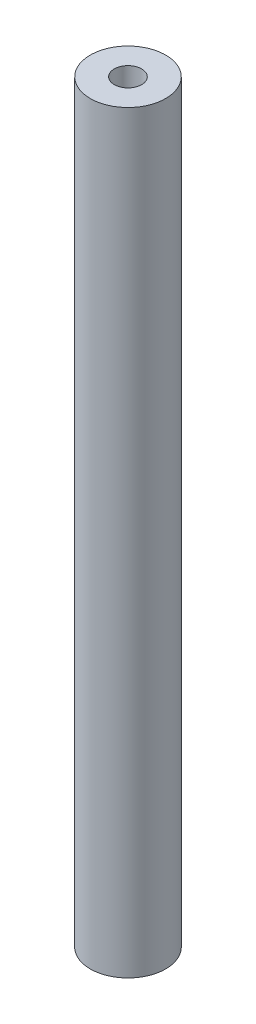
from build123d import *

# Parameters (mm, degrees)
SKETCH1_R                 = 4.7625
BOSS_EXTRUDE1_DEPTH       = 95.25
F_8_32_TAPPED_HOLE1_D     = 3.4544
F_8_32_TAPPED_HOLE1_DEPTH = 21.4376
F_8_32_TAPPED_HOLE1_TIP   = 1.037806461
F_8_32_TAPPED_HOLE2_D     = 3.4544
F_8_32_TAPPED_HOLE2_DEPTH = 21.4376
F_8_32_TAPPED_HOLE2_TIP   = 1.037806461


with BuildPart() as part:
    # Sketch1 → Boss-Extrude1 (new body)
    with BuildSketch(Plane(origin=(0, 0, 0), x_dir=(1, 0, 0), z_dir=(0, 1, 0))):
        with Locations(Location((0, 0, 0), (0, 0, 270))):
            Circle(SKETCH1_R)
    extrude(amount=BOSS_EXTRUDE1_DEPTH)

    # 8-32 Tapped Hole1
    with Locations(Plane(origin=(0, 0, 0), x_dir=(-1, 0, 0), z_dir=(0, -1, 0))):
        with Locations((0, 0)):
            Hole(F_8_32_TAPPED_HOLE1_D / 2, depth=F_8_32_TAPPED_HOLE1_DEPTH)
            with Locations((0, 0, -(F_8_32_TAPPED_HOLE1_DEPTH + F_8_32_TAPPED_HOLE1_TIP / 2))):  # 118° drill point
                Cone(0, F_8_32_TAPPED_HOLE1_D / 2, F_8_32_TAPPED_HOLE1_TIP, mode=Mode.SUBTRACT)

    # 8-32 Tapped Hole2
    with Locations(Plane(origin=(0, 95.25, 0), x_dir=(1, 0, 0), z_dir=(0, 1, 0))):
        with Locations((0, 0)):
            Hole(F_8_32_TAPPED_HOLE2_D / 2, depth=F_8_32_TAPPED_HOLE2_DEPTH)
            with Locations((0, 0, -(F_8_32_TAPPED_HOLE2_DEPTH + F_8_32_TAPPED_HOLE2_TIP / 2))):  # 118° drill point
                Cone(0, F_8_32_TAPPED_HOLE2_D / 2, F_8_32_TAPPED_HOLE2_TIP, mode=Mode.SUBTRACT)


solid = part.part
